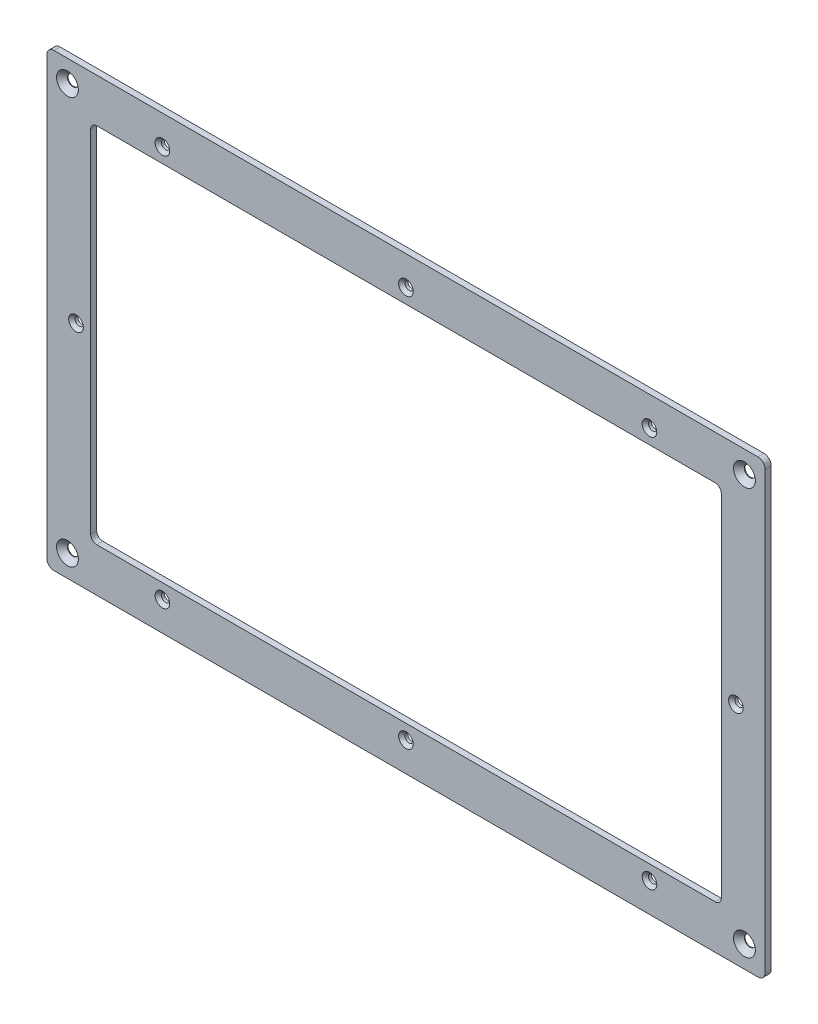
ISO-10303-21;
HEADER;
FILE_DESCRIPTION(('STEP AP214'),'2;1');
FILE_NAME('part.step','',(''),(''),'','','');
FILE_SCHEMA(('AUTOMOTIVE_DESIGN { 1 0 10303 214 1 1 1 1 }'));
ENDSEC;
DATA;
#1=APPLICATION_CONTEXT('core data for automotive mechanical design processes');
#2=APPLICATION_PROTOCOL_DEFINITION('international standard','automotive_design',2000,#1);
#3=PRODUCT_CONTEXT('',#1,'mechanical');
#4=PRODUCT('Part','Part','',(#3));
#5=PRODUCT_RELATED_PRODUCT_CATEGORY('part','',(#4));
#6=PRODUCT_DEFINITION_FORMATION('','',#4);
#7=PRODUCT_DEFINITION_CONTEXT('part definition',#1,'design');
#8=PRODUCT_DEFINITION('design','',#6,#7);
#9=PRODUCT_DEFINITION_SHAPE('','',#8);
#10=(LENGTH_UNIT() NAMED_UNIT(*) SI_UNIT(.MILLI.,.METRE.));
#11=(NAMED_UNIT(*) PLANE_ANGLE_UNIT() SI_UNIT($,.RADIAN.));
#12=(NAMED_UNIT(*) SI_UNIT($,.STERADIAN.) SOLID_ANGLE_UNIT());
#13=UNCERTAINTY_MEASURE_WITH_UNIT(LENGTH_MEASURE(1.E-05),#10,'distance_accuracy_value','');
#14=(GEOMETRIC_REPRESENTATION_CONTEXT(3) GLOBAL_UNCERTAINTY_ASSIGNED_CONTEXT((#13)) GLOBAL_UNIT_ASSIGNED_CONTEXT((#10,
#11,#12)) REPRESENTATION_CONTEXT('',''));
#15=CARTESIAN_POINT('',(0.,0.,0.));
#16=DIRECTION('',(0.,0.,1.));
#17=DIRECTION('',(1.,0.,0.));
#18=AXIS2_PLACEMENT_3D('',#15,#16,#17);
#19=CARTESIAN_POINT('',(144.5,-89.5,1.25));
#20=DIRECTION('',(0.,0.,-1.));
#21=DIRECTION('',(-1.,0.,0.));
#22=AXIS2_PLACEMENT_3D('',#19,#20,#21);
#23=CYLINDRICAL_SURFACE('',#22,3.00000000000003);
#24=CARTESIAN_POINT('',(144.5,-89.5,-1.25));
#25=DIRECTION('',(0.,0.,1.));
#26=DIRECTION('',(-1.,0.,0.));
#27=AXIS2_PLACEMENT_3D('',#24,#25,#26);
#28=CIRCLE('',#27,3.00000000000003);
#29=CARTESIAN_POINT('',(144.5,-92.5,-1.25));
#30=VERTEX_POINT('',#29);
#31=CARTESIAN_POINT('',(147.5,-89.5,-1.25));
#32=VERTEX_POINT('',#31);
#33=EDGE_CURVE('E205',#30,#32,#28,.T.);
#34=ORIENTED_EDGE('',*,*,#33,.T.);
#35=DIRECTION('',(0.,0.,-1.));
#36=VECTOR('',#35,1.);
#37=CARTESIAN_POINT('',(147.5,-89.5,1.25));
#38=LINE('',#37,#36);
#39=CARTESIAN_POINT('',(147.5,-89.5,1.25));
#40=VERTEX_POINT('',#39);
#41=EDGE_CURVE('E11',#40,#32,#38,.T.);
#42=ORIENTED_EDGE('',*,*,#41,.F.);
#43=CARTESIAN_POINT('',(144.5,-89.5,1.25));
#44=DIRECTION('',(0.,0.,1.));
#45=DIRECTION('',(-1.,0.,0.));
#46=AXIS2_PLACEMENT_3D('',#43,#44,#45);
#47=CIRCLE('',#46,3.00000000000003);
#48=CARTESIAN_POINT('',(144.5,-92.5,1.25));
#49=VERTEX_POINT('',#48);
#50=EDGE_CURVE('E217',#49,#40,#47,.T.);
#51=ORIENTED_EDGE('',*,*,#50,.F.);
#52=DIRECTION('',(0.,0.,-1.));
#53=VECTOR('',#52,1.);
#54=CARTESIAN_POINT('',(144.5,-92.5,1.25));
#55=LINE('',#54,#53);
#56=EDGE_CURVE('E235',#49,#30,#55,.T.);
#57=ORIENTED_EDGE('',*,*,#56,.T.);
#58=EDGE_LOOP('',(#34,#42,#51,#57));
#59=FACE_BOUND('',#58,.T.);
#60=ADVANCED_FACE('F33',(#59),#23,.T.);
#61=CARTESIAN_POINT('',(147.5,89.5,1.25));
#62=DIRECTION('',(-1.,0.,0.));
#63=DIRECTION('',(0.,-1.,0.));
#64=AXIS2_PLACEMENT_3D('',#61,#62,#63);
#65=PLANE('',#64);
#66=DIRECTION('',(0.,1.,0.));
#67=VECTOR('',#66,1.);
#68=CARTESIAN_POINT('',(147.5,89.5,-1.25));
#69=LINE('',#68,#67);
#70=CARTESIAN_POINT('',(147.5,89.5,-1.25));
#71=VERTEX_POINT('',#70);
#72=EDGE_CURVE('E238',#32,#71,#69,.T.);
#73=ORIENTED_EDGE('',*,*,#72,.T.);
#74=DIRECTION('',(0.,0.,-1.));
#75=VECTOR('',#74,1.);
#76=CARTESIAN_POINT('',(147.5,89.5,1.25));
#77=LINE('',#76,#75);
#78=CARTESIAN_POINT('',(147.5,89.5,1.25));
#79=VERTEX_POINT('',#78);
#80=EDGE_CURVE('E40',#79,#71,#77,.T.);
#81=ORIENTED_EDGE('',*,*,#80,.F.);
#82=DIRECTION('',(0.,1.,0.));
#83=VECTOR('',#82,1.);
#84=CARTESIAN_POINT('',(147.5,89.5,1.25));
#85=LINE('',#84,#83);
#86=EDGE_CURVE('E220',#40,#79,#85,.T.);
#87=ORIENTED_EDGE('',*,*,#86,.F.);
#88=ORIENTED_EDGE('',*,*,#41,.T.);
#89=EDGE_LOOP('',(#73,#81,#87,#88));
#90=FACE_BOUND('',#89,.T.);
#91=ADVANCED_FACE('F293',(#90),#65,.F.);
#92=CARTESIAN_POINT('',(144.5,89.5,1.25));
#93=DIRECTION('',(0.,0.,-1.));
#94=DIRECTION('',(-1.,0.,0.));
#95=AXIS2_PLACEMENT_3D('',#92,#93,#94);
#96=CYLINDRICAL_SURFACE('',#95,3.00000000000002);
#97=CARTESIAN_POINT('',(144.5,89.5,-1.25));
#98=DIRECTION('',(0.,0.,1.));
#99=DIRECTION('',(-1.,0.,0.));
#100=AXIS2_PLACEMENT_3D('',#97,#98,#99);
#101=CIRCLE('',#100,3.00000000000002);
#102=CARTESIAN_POINT('',(144.5,92.5,-1.25));
#103=VERTEX_POINT('',#102);
#104=EDGE_CURVE('E240',#71,#103,#101,.T.);
#105=ORIENTED_EDGE('',*,*,#104,.T.);
#106=DIRECTION('',(0.,0.,-1.));
#107=VECTOR('',#106,1.);
#108=CARTESIAN_POINT('',(144.5,92.5,1.25));
#109=LINE('',#108,#107);
#110=CARTESIAN_POINT('',(144.5,92.5,1.25));
#111=VERTEX_POINT('',#110);
#112=EDGE_CURVE('E265',#111,#103,#109,.T.);
#113=ORIENTED_EDGE('',*,*,#112,.F.);
#114=CARTESIAN_POINT('',(144.5,89.5,1.25));
#115=DIRECTION('',(0.,0.,1.));
#116=DIRECTION('',(-1.,0.,0.));
#117=AXIS2_PLACEMENT_3D('',#114,#115,#116);
#118=CIRCLE('',#117,3.00000000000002);
#119=EDGE_CURVE('E223',#79,#111,#118,.T.);
#120=ORIENTED_EDGE('',*,*,#119,.F.);
#121=ORIENTED_EDGE('',*,*,#80,.T.);
#122=EDGE_LOOP('',(#105,#113,#120,#121));
#123=FACE_BOUND('',#122,.T.);
#124=ADVANCED_FACE('F272',(#123),#96,.T.);
#125=CARTESIAN_POINT('',(-144.5,92.5,1.25));
#126=DIRECTION('',(0.,-1.,0.));
#127=DIRECTION('',(0.,0.,-1.));
#128=AXIS2_PLACEMENT_3D('',#125,#126,#127);
#129=PLANE('',#128);
#130=DIRECTION('',(-1.,0.,0.));
#131=VECTOR('',#130,1.);
#132=CARTESIAN_POINT('',(-144.5,92.5,-1.25));
#133=LINE('',#132,#131);
#134=CARTESIAN_POINT('',(-144.5,92.5,-1.25));
#135=VERTEX_POINT('',#134);
#136=EDGE_CURVE('E242',#103,#135,#133,.T.);
#137=ORIENTED_EDGE('',*,*,#136,.T.);
#138=DIRECTION('',(0.,0.,-1.));
#139=VECTOR('',#138,1.);
#140=CARTESIAN_POINT('',(-144.5,92.5,1.25));
#141=LINE('',#140,#139);
#142=CARTESIAN_POINT('',(-144.5,92.5,1.25));
#143=VERTEX_POINT('',#142);
#144=EDGE_CURVE('E262',#143,#135,#141,.T.);
#145=ORIENTED_EDGE('',*,*,#144,.F.);
#146=DIRECTION('',(-1.,0.,0.));
#147=VECTOR('',#146,1.);
#148=CARTESIAN_POINT('',(-144.5,92.5,1.25));
#149=LINE('',#148,#147);
#150=EDGE_CURVE('E225',#111,#143,#149,.T.);
#151=ORIENTED_EDGE('',*,*,#150,.F.);
#152=ORIENTED_EDGE('',*,*,#112,.T.);
#153=EDGE_LOOP('',(#137,#145,#151,#152));
#154=FACE_BOUND('',#153,.T.);
#155=ADVANCED_FACE('F281',(#154),#129,.F.);
#156=CARTESIAN_POINT('',(-144.5,89.5,1.25));
#157=DIRECTION('',(0.,0.,-1.));
#158=DIRECTION('',(-1.,0.,0.));
#159=AXIS2_PLACEMENT_3D('',#156,#157,#158);
#160=CYLINDRICAL_SURFACE('',#159,3.);
#161=CARTESIAN_POINT('',(-144.5,89.5,-1.25));
#162=DIRECTION('',(0.,0.,1.));
#163=DIRECTION('',(-1.,0.,0.));
#164=AXIS2_PLACEMENT_3D('',#161,#162,#163);
#165=CIRCLE('',#164,3.);
#166=CARTESIAN_POINT('',(-147.5,89.5,-1.25));
#167=VERTEX_POINT('',#166);
#168=EDGE_CURVE('E244',#135,#167,#165,.T.);
#169=ORIENTED_EDGE('',*,*,#168,.T.);
#170=DIRECTION('',(0.,0.,-1.));
#171=VECTOR('',#170,1.);
#172=CARTESIAN_POINT('',(-147.5,89.5,1.25));
#173=LINE('',#172,#171);
#174=CARTESIAN_POINT('',(-147.5,89.5,1.25));
#175=VERTEX_POINT('',#174);
#176=EDGE_CURVE('E259',#175,#167,#173,.T.);
#177=ORIENTED_EDGE('',*,*,#176,.F.);
#178=CARTESIAN_POINT('',(-144.5,89.5,1.25));
#179=DIRECTION('',(0.,0.,1.));
#180=DIRECTION('',(-1.,0.,0.));
#181=AXIS2_PLACEMENT_3D('',#178,#179,#180);
#182=CIRCLE('',#181,3.);
#183=EDGE_CURVE('E227',#143,#175,#182,.T.);
#184=ORIENTED_EDGE('',*,*,#183,.F.);
#185=ORIENTED_EDGE('',*,*,#144,.T.);
#186=EDGE_LOOP('',(#169,#177,#184,#185));
#187=FACE_BOUND('',#186,.T.);
#188=ADVANCED_FACE('F285',(#187),#160,.T.);
#189=CARTESIAN_POINT('',(-147.5,89.5,1.25));
#190=DIRECTION('',(1.,0.,0.));
#191=DIRECTION('',(0.,1.,0.));
#192=AXIS2_PLACEMENT_3D('',#189,#190,#191);
#193=PLANE('',#192);
#194=DIRECTION('',(0.,-1.,0.));
#195=VECTOR('',#194,1.);
#196=CARTESIAN_POINT('',(-147.5,89.5,-1.25));
#197=LINE('',#196,#195);
#198=CARTESIAN_POINT('',(-147.5,-89.5,-1.25));
#199=VERTEX_POINT('',#198);
#200=EDGE_CURVE('E246',#167,#199,#197,.T.);
#201=ORIENTED_EDGE('',*,*,#200,.T.);
#202=DIRECTION('',(0.,0.,-1.));
#203=VECTOR('',#202,1.);
#204=CARTESIAN_POINT('',(-147.5,-89.5,1.25));
#205=LINE('',#204,#203);
#206=CARTESIAN_POINT('',(-147.5,-89.5,1.25));
#207=VERTEX_POINT('',#206);
#208=EDGE_CURVE('E256',#207,#199,#205,.T.);
#209=ORIENTED_EDGE('',*,*,#208,.F.);
#210=DIRECTION('',(0.,-1.,0.));
#211=VECTOR('',#210,1.);
#212=CARTESIAN_POINT('',(-147.5,89.5,1.25));
#213=LINE('',#212,#211);
#214=EDGE_CURVE('E229',#175,#207,#213,.T.);
#215=ORIENTED_EDGE('',*,*,#214,.F.);
#216=ORIENTED_EDGE('',*,*,#176,.T.);
#217=EDGE_LOOP('',(#201,#209,#215,#216));
#218=FACE_BOUND('',#217,.T.);
#219=ADVANCED_FACE('F306',(#218),#193,.F.);
#220=CARTESIAN_POINT('',(-144.5,-89.5,1.25));
#221=DIRECTION('',(0.,0.,-1.));
#222=DIRECTION('',(-1.,0.,0.));
#223=AXIS2_PLACEMENT_3D('',#220,#221,#222);
#224=CYLINDRICAL_SURFACE('',#223,3.);
#225=CARTESIAN_POINT('',(-144.5,-89.5,-1.25));
#226=DIRECTION('',(0.,0.,1.));
#227=DIRECTION('',(-1.,0.,0.));
#228=AXIS2_PLACEMENT_3D('',#225,#226,#227);
#229=CIRCLE('',#228,3.);
#230=CARTESIAN_POINT('',(-144.5,-92.5,-1.25));
#231=VERTEX_POINT('',#230);
#232=EDGE_CURVE('E248',#199,#231,#229,.T.);
#233=ORIENTED_EDGE('',*,*,#232,.T.);
#234=DIRECTION('',(0.,0.,-1.));
#235=VECTOR('',#234,1.);
#236=CARTESIAN_POINT('',(-144.5,-92.5,1.25));
#237=LINE('',#236,#235);
#238=CARTESIAN_POINT('',(-144.5,-92.5,1.25));
#239=VERTEX_POINT('',#238);
#240=EDGE_CURVE('E253',#239,#231,#237,.T.);
#241=ORIENTED_EDGE('',*,*,#240,.F.);
#242=CARTESIAN_POINT('',(-144.5,-89.5,1.25));
#243=DIRECTION('',(0.,0.,1.));
#244=DIRECTION('',(-1.,0.,0.));
#245=AXIS2_PLACEMENT_3D('',#242,#243,#244);
#246=CIRCLE('',#245,3.);
#247=EDGE_CURVE('E231',#207,#239,#246,.T.);
#248=ORIENTED_EDGE('',*,*,#247,.F.);
#249=ORIENTED_EDGE('',*,*,#208,.T.);
#250=EDGE_LOOP('',(#233,#241,#248,#249));
#251=FACE_BOUND('',#250,.T.);
#252=ADVANCED_FACE('F304',(#251),#224,.T.);
#253=CARTESIAN_POINT('',(-144.5,-92.5,1.25));
#254=DIRECTION('',(0.,1.,0.));
#255=DIRECTION('',(0.,0.,1.));
#256=AXIS2_PLACEMENT_3D('',#253,#254,#255);
#257=PLANE('',#256);
#258=DIRECTION('',(1.,0.,0.));
#259=VECTOR('',#258,1.);
#260=CARTESIAN_POINT('',(-144.5,-92.5,-1.25));
#261=LINE('',#260,#259);
#262=EDGE_CURVE('E221',#231,#30,#261,.T.);
#263=ORIENTED_EDGE('',*,*,#262,.T.);
#264=ORIENTED_EDGE('',*,*,#56,.F.);
#265=DIRECTION('',(1.,0.,0.));
#266=VECTOR('',#265,1.);
#267=CARTESIAN_POINT('',(-144.5,-92.5,1.25));
#268=LINE('',#267,#266);
#269=EDGE_CURVE('E233',#239,#49,#268,.T.);
#270=ORIENTED_EDGE('',*,*,#269,.F.);
#271=ORIENTED_EDGE('',*,*,#240,.T.);
#272=EDGE_LOOP('',(#263,#264,#270,#271));
#273=FACE_BOUND('',#272,.T.);
#274=ADVANCED_FACE('F299',(#273),#257,.F.);
#275=CARTESIAN_POINT('',(144.5,-89.5,1.25));
#276=DIRECTION('',(0.,0.,-1.));
#277=DIRECTION('',(-1.,0.,0.));
#278=AXIS2_PLACEMENT_3D('',#275,#276,#277);
#279=PLANE('',#278);
#280=CARTESIAN_POINT('',(-139.,-83.5,1.25));
#281=DIRECTION('',(0.,0.,1.));
#282=DIRECTION('',(1.,0.,0.));
#283=AXIS2_PLACEMENT_3D('',#280,#281,#282);
#284=CIRCLE('',#283,4.48000000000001);
#285=CARTESIAN_POINT('',(-134.52,-83.5,1.25));
#286=VERTEX_POINT('',#285);
#287=EDGE_CURVE('E694',#286,#286,#284,.T.);
#288=ORIENTED_EDGE('',*,*,#287,.F.);
#289=EDGE_LOOP('',(#288));
#290=FACE_BOUND('',#289,.T.);
#291=CARTESIAN_POINT('',(139.,-83.5,1.25));
#292=DIRECTION('',(0.,0.,1.));
#293=DIRECTION('',(1.,0.,0.));
#294=AXIS2_PLACEMENT_3D('',#291,#292,#293);
#295=CIRCLE('',#294,4.48000000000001);
#296=CARTESIAN_POINT('',(143.48,-83.5,1.25));
#297=VERTEX_POINT('',#296);
#298=EDGE_CURVE('E701',#297,#297,#295,.T.);
#299=ORIENTED_EDGE('',*,*,#298,.F.);
#300=EDGE_LOOP('',(#299));
#301=FACE_BOUND('',#300,.T.);
#302=CARTESIAN_POINT('',(-139.,83.5,1.25));
#303=DIRECTION('',(0.,0.,1.));
#304=DIRECTION('',(1.,0.,0.));
#305=AXIS2_PLACEMENT_3D('',#302,#303,#304);
#306=CIRCLE('',#305,4.48000000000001);
#307=CARTESIAN_POINT('',(-134.52,83.5,1.25));
#308=VERTEX_POINT('',#307);
#309=EDGE_CURVE('E710',#308,#308,#306,.T.);
#310=ORIENTED_EDGE('',*,*,#309,.F.);
#311=EDGE_LOOP('',(#310));
#312=FACE_BOUND('',#311,.T.);
#313=CARTESIAN_POINT('',(0.,80.5,1.25));
#314=DIRECTION('',(0.,0.,1.));
#315=DIRECTION('',(1.,0.,0.));
#316=AXIS2_PLACEMENT_3D('',#313,#314,#315);
#317=CIRCLE('',#316,3.);
#318=CARTESIAN_POINT('',(3.,80.5,1.25));
#319=VERTEX_POINT('',#318);
#320=EDGE_CURVE('E719',#319,#319,#317,.T.);
#321=ORIENTED_EDGE('',*,*,#320,.F.);
#322=EDGE_LOOP('',(#321));
#323=FACE_BOUND('',#322,.T.);
#324=CARTESIAN_POINT('',(-100.,80.5,1.25));
#325=DIRECTION('',(0.,0.,1.));
#326=DIRECTION('',(1.,0.,0.));
#327=AXIS2_PLACEMENT_3D('',#324,#325,#326);
#328=CIRCLE('',#327,3.);
#329=CARTESIAN_POINT('',(-97.,80.5,1.25));
#330=VERTEX_POINT('',#329);
#331=EDGE_CURVE('E728',#330,#330,#328,.T.);
#332=ORIENTED_EDGE('',*,*,#331,.F.);
#333=EDGE_LOOP('',(#332));
#334=FACE_BOUND('',#333,.T.);
#335=CARTESIAN_POINT('',(100.,80.5,1.25));
#336=DIRECTION('',(0.,0.,1.));
#337=DIRECTION('',(1.,0.,0.));
#338=AXIS2_PLACEMENT_3D('',#335,#336,#337);
#339=CIRCLE('',#338,3.);
#340=CARTESIAN_POINT('',(103.,80.5,1.25));
#341=VERTEX_POINT('',#340);
#342=EDGE_CURVE('E737',#341,#341,#339,.T.);
#343=ORIENTED_EDGE('',*,*,#342,.F.);
#344=EDGE_LOOP('',(#343));
#345=FACE_BOUND('',#344,.T.);
#346=CARTESIAN_POINT('',(0.,-80.5,1.25));
#347=DIRECTION('',(0.,0.,1.));
#348=DIRECTION('',(1.,0.,0.));
#349=AXIS2_PLACEMENT_3D('',#346,#347,#348);
#350=CIRCLE('',#349,3.);
#351=CARTESIAN_POINT('',(3.,-80.5,1.25));
#352=VERTEX_POINT('',#351);
#353=EDGE_CURVE('E746',#352,#352,#350,.T.);
#354=ORIENTED_EDGE('',*,*,#353,.F.);
#355=EDGE_LOOP('',(#354));
#356=FACE_BOUND('',#355,.T.);
#357=CARTESIAN_POINT('',(-100.,-80.5,1.25));
#358=DIRECTION('',(0.,0.,1.));
#359=DIRECTION('',(1.,0.,0.));
#360=AXIS2_PLACEMENT_3D('',#357,#358,#359);
#361=CIRCLE('',#360,3.);
#362=CARTESIAN_POINT('',(-97.,-80.5,1.25));
#363=VERTEX_POINT('',#362);
#364=EDGE_CURVE('E755',#363,#363,#361,.T.);
#365=ORIENTED_EDGE('',*,*,#364,.F.);
#366=EDGE_LOOP('',(#365));
#367=FACE_BOUND('',#366,.T.);
#368=CARTESIAN_POINT('',(100.,-80.5,1.25));
#369=DIRECTION('',(0.,0.,1.));
#370=DIRECTION('',(1.,0.,0.));
#371=AXIS2_PLACEMENT_3D('',#368,#369,#370);
#372=CIRCLE('',#371,3.);
#373=CARTESIAN_POINT('',(103.,-80.5,1.25));
#374=VERTEX_POINT('',#373);
#375=EDGE_CURVE('E764',#374,#374,#372,.T.);
#376=ORIENTED_EDGE('',*,*,#375,.F.);
#377=EDGE_LOOP('',(#376));
#378=FACE_BOUND('',#377,.T.);
#379=CARTESIAN_POINT('',(-135.5,0.,1.25));
#380=DIRECTION('',(0.,0.,1.));
#381=DIRECTION('',(1.,0.,0.));
#382=AXIS2_PLACEMENT_3D('',#379,#380,#381);
#383=CIRCLE('',#382,3.);
#384=CARTESIAN_POINT('',(-132.5,0.,1.25));
#385=VERTEX_POINT('',#384);
#386=EDGE_CURVE('E773',#385,#385,#383,.T.);
#387=ORIENTED_EDGE('',*,*,#386,.F.);
#388=EDGE_LOOP('',(#387));
#389=FACE_BOUND('',#388,.T.);
#390=CARTESIAN_POINT('',(135.5,0.,1.25));
#391=DIRECTION('',(0.,0.,1.));
#392=DIRECTION('',(1.,0.,0.));
#393=AXIS2_PLACEMENT_3D('',#390,#391,#392);
#394=CIRCLE('',#393,3.);
#395=CARTESIAN_POINT('',(138.5,0.,1.25));
#396=VERTEX_POINT('',#395);
#397=EDGE_CURVE('E782',#396,#396,#394,.T.);
#398=ORIENTED_EDGE('',*,*,#397,.F.);
#399=EDGE_LOOP('',(#398));
#400=FACE_BOUND('',#399,.T.);
#401=CARTESIAN_POINT('',(139.,83.5,1.25));
#402=DIRECTION('',(0.,0.,1.));
#403=DIRECTION('',(1.,0.,0.));
#404=AXIS2_PLACEMENT_3D('',#401,#402,#403);
#405=CIRCLE('',#404,4.48000000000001);
#406=CARTESIAN_POINT('',(143.48,83.5,1.25));
#407=VERTEX_POINT('',#406);
#408=EDGE_CURVE('E791',#407,#407,#405,.T.);
#409=ORIENTED_EDGE('',*,*,#408,.F.);
#410=EDGE_LOOP('',(#409));
#411=FACE_BOUND('',#410,.T.);
#412=DIRECTION('',(-1.,0.,0.));
#413=VECTOR('',#412,1.);
#414=CARTESIAN_POINT('',(-127.,74.5,1.25));
#415=LINE('',#414,#413);
#416=CARTESIAN_POINT('',(127.,74.5,1.25));
#417=VERTEX_POINT('',#416);
#418=CARTESIAN_POINT('',(-127.,74.5,1.25));
#419=VERTEX_POINT('',#418);
#420=EDGE_CURVE('E187',#417,#419,#415,.T.);
#421=ORIENTED_EDGE('',*,*,#420,.F.);
#422=CARTESIAN_POINT('',(127.,72.,1.25));
#423=DIRECTION('',(0.,0.,1.));
#424=DIRECTION('',(1.,0.,0.));
#425=AXIS2_PLACEMENT_3D('',#422,#423,#424);
#426=CIRCLE('',#425,2.50000000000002);
#427=CARTESIAN_POINT('',(129.5,72.,1.25));
#428=VERTEX_POINT('',#427);
#429=EDGE_CURVE('E47',#428,#417,#426,.T.);
#430=ORIENTED_EDGE('',*,*,#429,.F.);
#431=DIRECTION('',(0.,1.,0.));
#432=VECTOR('',#431,1.);
#433=CARTESIAN_POINT('',(129.5,72.,1.25));
#434=LINE('',#433,#432);
#435=CARTESIAN_POINT('',(129.5,-72.,1.25));
#436=VERTEX_POINT('',#435);
#437=EDGE_CURVE('E164',#436,#428,#434,.T.);
#438=ORIENTED_EDGE('',*,*,#437,.F.);
#439=CARTESIAN_POINT('',(127.,-72.,1.25));
#440=DIRECTION('',(0.,0.,1.));
#441=DIRECTION('',(-1.,0.,0.));
#442=AXIS2_PLACEMENT_3D('',#439,#440,#441);
#443=CIRCLE('',#442,2.50000000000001);
#444=CARTESIAN_POINT('',(127.,-74.5,1.25));
#445=VERTEX_POINT('',#444);
#446=EDGE_CURVE('E167',#445,#436,#443,.T.);
#447=ORIENTED_EDGE('',*,*,#446,.F.);
#448=DIRECTION('',(1.,0.,0.));
#449=VECTOR('',#448,1.);
#450=CARTESIAN_POINT('',(-127.,-74.5,1.25));
#451=LINE('',#450,#449);
#452=CARTESIAN_POINT('',(-127.,-74.5,1.25));
#453=VERTEX_POINT('',#452);
#454=EDGE_CURVE('E198',#453,#445,#451,.T.);
#455=ORIENTED_EDGE('',*,*,#454,.F.);
#456=CARTESIAN_POINT('',(-127.,-72.,1.25));
#457=DIRECTION('',(0.,0.,1.));
#458=DIRECTION('',(-1.,0.,0.));
#459=AXIS2_PLACEMENT_3D('',#456,#457,#458);
#460=CIRCLE('',#459,2.5);
#461=CARTESIAN_POINT('',(-129.5,-72.,1.25));
#462=VERTEX_POINT('',#461);
#463=EDGE_CURVE('E195',#462,#453,#460,.T.);
#464=ORIENTED_EDGE('',*,*,#463,.F.);
#465=DIRECTION('',(0.,-1.,0.));
#466=VECTOR('',#465,1.);
#467=CARTESIAN_POINT('',(-129.5,72.,1.25));
#468=LINE('',#467,#466);
#469=CARTESIAN_POINT('',(-129.5,72.,1.25));
#470=VERTEX_POINT('',#469);
#471=EDGE_CURVE('E192',#470,#462,#468,.T.);
#472=ORIENTED_EDGE('',*,*,#471,.F.);
#473=CARTESIAN_POINT('',(-127.,72.,1.25));
#474=DIRECTION('',(0.,0.,1.));
#475=DIRECTION('',(-1.,0.,0.));
#476=AXIS2_PLACEMENT_3D('',#473,#474,#475);
#477=CIRCLE('',#476,2.5);
#478=EDGE_CURVE('E189',#419,#470,#477,.T.);
#479=ORIENTED_EDGE('',*,*,#478,.F.);
#480=EDGE_LOOP('',(#421,#430,#438,#447,#455,#464,#472,#479));
#481=FACE_BOUND('',#480,.T.);
#482=ORIENTED_EDGE('',*,*,#50,.T.);
#483=ORIENTED_EDGE('',*,*,#86,.T.);
#484=ORIENTED_EDGE('',*,*,#119,.T.);
#485=ORIENTED_EDGE('',*,*,#150,.T.);
#486=ORIENTED_EDGE('',*,*,#183,.T.);
#487=ORIENTED_EDGE('',*,*,#214,.T.);
#488=ORIENTED_EDGE('',*,*,#247,.T.);
#489=ORIENTED_EDGE('',*,*,#269,.T.);
#490=EDGE_LOOP('',(#482,#483,#484,#485,#486,#487,#488,#489));
#491=FACE_BOUND('',#490,.T.);
#492=ADVANCED_FACE('F289',(#290,#301,#312,#323,#334,#345,#356,#367,#378,#389,#400,#411,#481,
#491),#279,.F.);
#493=CARTESIAN_POINT('',(144.5,-89.5,-1.25));
#494=DIRECTION('',(0.,0.,-1.));
#495=DIRECTION('',(-1.,0.,0.));
#496=AXIS2_PLACEMENT_3D('',#493,#494,#495);
#497=PLANE('',#496);
#498=CARTESIAN_POINT('',(-139.,-83.5,-1.25));
#499=DIRECTION('',(0.,0.,1.));
#500=DIRECTION('',(1.,0.,0.));
#501=AXIS2_PLACEMENT_3D('',#498,#499,#500);
#502=CIRCLE('',#501,2.25);
#503=CARTESIAN_POINT('',(-136.75,-83.5,-1.25));
#504=VERTEX_POINT('',#503);
#505=EDGE_CURVE('E696',#504,#504,#502,.T.);
#506=ORIENTED_EDGE('',*,*,#505,.T.);
#507=EDGE_LOOP('',(#506));
#508=FACE_BOUND('',#507,.T.);
#509=CARTESIAN_POINT('',(139.,-83.5,-1.25));
#510=DIRECTION('',(0.,0.,1.));
#511=DIRECTION('',(1.,0.,0.));
#512=AXIS2_PLACEMENT_3D('',#509,#510,#511);
#513=CIRCLE('',#512,2.25);
#514=CARTESIAN_POINT('',(141.25,-83.5,-1.25));
#515=VERTEX_POINT('',#514);
#516=EDGE_CURVE('E707',#515,#515,#513,.T.);
#517=ORIENTED_EDGE('',*,*,#516,.T.);
#518=EDGE_LOOP('',(#517));
#519=FACE_BOUND('',#518,.T.);
#520=CARTESIAN_POINT('',(-139.,83.5,-1.25));
#521=DIRECTION('',(0.,0.,1.));
#522=DIRECTION('',(1.,0.,0.));
#523=AXIS2_PLACEMENT_3D('',#520,#521,#522);
#524=CIRCLE('',#523,2.25);
#525=CARTESIAN_POINT('',(-136.75,83.5,-1.25));
#526=VERTEX_POINT('',#525);
#527=EDGE_CURVE('E716',#526,#526,#524,.T.);
#528=ORIENTED_EDGE('',*,*,#527,.T.);
#529=EDGE_LOOP('',(#528));
#530=FACE_BOUND('',#529,.T.);
#531=CARTESIAN_POINT('',(0.,80.5,-1.25));
#532=DIRECTION('',(0.,0.,1.));
#533=DIRECTION('',(1.,0.,0.));
#534=AXIS2_PLACEMENT_3D('',#531,#532,#533);
#535=CIRCLE('',#534,1.7);
#536=CARTESIAN_POINT('',(1.7,80.5,-1.25));
#537=VERTEX_POINT('',#536);
#538=EDGE_CURVE('E725',#537,#537,#535,.T.);
#539=ORIENTED_EDGE('',*,*,#538,.T.);
#540=EDGE_LOOP('',(#539));
#541=FACE_BOUND('',#540,.T.);
#542=CARTESIAN_POINT('',(-100.,80.5,-1.25));
#543=DIRECTION('',(0.,0.,1.));
#544=DIRECTION('',(1.,0.,0.));
#545=AXIS2_PLACEMENT_3D('',#542,#543,#544);
#546=CIRCLE('',#545,1.69999999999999);
#547=CARTESIAN_POINT('',(-98.3,80.5,-1.25));
#548=VERTEX_POINT('',#547);
#549=EDGE_CURVE('E734',#548,#548,#546,.T.);
#550=ORIENTED_EDGE('',*,*,#549,.T.);
#551=EDGE_LOOP('',(#550));
#552=FACE_BOUND('',#551,.T.);
#553=CARTESIAN_POINT('',(100.,80.5,-1.25));
#554=DIRECTION('',(0.,0.,1.));
#555=DIRECTION('',(1.,0.,0.));
#556=AXIS2_PLACEMENT_3D('',#553,#554,#555);
#557=CIRCLE('',#556,1.69999999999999);
#558=CARTESIAN_POINT('',(101.7,80.5,-1.25));
#559=VERTEX_POINT('',#558);
#560=EDGE_CURVE('E743',#559,#559,#557,.T.);
#561=ORIENTED_EDGE('',*,*,#560,.T.);
#562=EDGE_LOOP('',(#561));
#563=FACE_BOUND('',#562,.T.);
#564=CARTESIAN_POINT('',(0.,-80.5,-1.25));
#565=DIRECTION('',(0.,0.,1.));
#566=DIRECTION('',(1.,0.,0.));
#567=AXIS2_PLACEMENT_3D('',#564,#565,#566);
#568=CIRCLE('',#567,1.7);
#569=CARTESIAN_POINT('',(1.7,-80.5,-1.25));
#570=VERTEX_POINT('',#569);
#571=EDGE_CURVE('E752',#570,#570,#568,.T.);
#572=ORIENTED_EDGE('',*,*,#571,.T.);
#573=EDGE_LOOP('',(#572));
#574=FACE_BOUND('',#573,.T.);
#575=CARTESIAN_POINT('',(-100.,-80.5,-1.25));
#576=DIRECTION('',(0.,0.,1.));
#577=DIRECTION('',(1.,0.,0.));
#578=AXIS2_PLACEMENT_3D('',#575,#576,#577);
#579=CIRCLE('',#578,1.69999999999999);
#580=CARTESIAN_POINT('',(-98.3,-80.5,-1.25));
#581=VERTEX_POINT('',#580);
#582=EDGE_CURVE('E761',#581,#581,#579,.T.);
#583=ORIENTED_EDGE('',*,*,#582,.T.);
#584=EDGE_LOOP('',(#583));
#585=FACE_BOUND('',#584,.T.);
#586=CARTESIAN_POINT('',(100.,-80.5,-1.25));
#587=DIRECTION('',(0.,0.,1.));
#588=DIRECTION('',(1.,0.,0.));
#589=AXIS2_PLACEMENT_3D('',#586,#587,#588);
#590=CIRCLE('',#589,1.69999999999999);
#591=CARTESIAN_POINT('',(101.7,-80.5,-1.25));
#592=VERTEX_POINT('',#591);
#593=EDGE_CURVE('E770',#592,#592,#590,.T.);
#594=ORIENTED_EDGE('',*,*,#593,.T.);
#595=EDGE_LOOP('',(#594));
#596=FACE_BOUND('',#595,.T.);
#597=CARTESIAN_POINT('',(-135.5,0.,-1.25));
#598=DIRECTION('',(0.,0.,1.));
#599=DIRECTION('',(1.,0.,0.));
#600=AXIS2_PLACEMENT_3D('',#597,#598,#599);
#601=CIRCLE('',#600,1.70000000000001);
#602=CARTESIAN_POINT('',(-133.8,0.,-1.25));
#603=VERTEX_POINT('',#602);
#604=EDGE_CURVE('E779',#603,#603,#601,.T.);
#605=ORIENTED_EDGE('',*,*,#604,.T.);
#606=EDGE_LOOP('',(#605));
#607=FACE_BOUND('',#606,.T.);
#608=CARTESIAN_POINT('',(135.5,0.,-1.25));
#609=DIRECTION('',(0.,0.,1.));
#610=DIRECTION('',(1.,0.,0.));
#611=AXIS2_PLACEMENT_3D('',#608,#609,#610);
#612=CIRCLE('',#611,1.70000000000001);
#613=CARTESIAN_POINT('',(137.2,0.,-1.25));
#614=VERTEX_POINT('',#613);
#615=EDGE_CURVE('E788',#614,#614,#612,.T.);
#616=ORIENTED_EDGE('',*,*,#615,.T.);
#617=EDGE_LOOP('',(#616));
#618=FACE_BOUND('',#617,.T.);
#619=CARTESIAN_POINT('',(139.,83.5,-1.25));
#620=DIRECTION('',(0.,0.,1.));
#621=DIRECTION('',(1.,0.,0.));
#622=AXIS2_PLACEMENT_3D('',#619,#620,#621);
#623=CIRCLE('',#622,2.25);
#624=CARTESIAN_POINT('',(141.25,83.5,-1.25));
#625=VERTEX_POINT('',#624);
#626=EDGE_CURVE('E170',#625,#625,#623,.T.);
#627=ORIENTED_EDGE('',*,*,#626,.T.);
#628=EDGE_LOOP('',(#627));
#629=FACE_BOUND('',#628,.T.);
#630=CARTESIAN_POINT('',(127.,72.,-1.25));
#631=DIRECTION('',(0.,0.,1.));
#632=DIRECTION('',(1.,0.,0.));
#633=AXIS2_PLACEMENT_3D('',#630,#631,#632);
#634=CIRCLE('',#633,2.50000000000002);
#635=CARTESIAN_POINT('',(129.5,72.,-1.25));
#636=VERTEX_POINT('',#635);
#637=CARTESIAN_POINT('',(127.,74.5,-1.25));
#638=VERTEX_POINT('',#637);
#639=EDGE_CURVE('E147',#636,#638,#634,.T.);
#640=ORIENTED_EDGE('',*,*,#639,.T.);
#641=DIRECTION('',(-1.,0.,0.));
#642=VECTOR('',#641,1.);
#643=CARTESIAN_POINT('',(-127.,74.5,-1.25));
#644=LINE('',#643,#642);
#645=CARTESIAN_POINT('',(-127.,74.5,-1.25));
#646=VERTEX_POINT('',#645);
#647=EDGE_CURVE('E156',#638,#646,#644,.T.);
#648=ORIENTED_EDGE('',*,*,#647,.T.);
#649=CARTESIAN_POINT('',(-127.,72.,-1.25));
#650=DIRECTION('',(0.,0.,1.));
#651=DIRECTION('',(-1.,0.,0.));
#652=AXIS2_PLACEMENT_3D('',#649,#650,#651);
#653=CIRCLE('',#652,2.5);
#654=CARTESIAN_POINT('',(-129.5,72.,-1.25));
#655=VERTEX_POINT('',#654);
#656=EDGE_CURVE('E55',#646,#655,#653,.T.);
#657=ORIENTED_EDGE('',*,*,#656,.T.);
#658=DIRECTION('',(0.,-1.,0.));
#659=VECTOR('',#658,1.);
#660=CARTESIAN_POINT('',(-129.5,72.,-1.25));
#661=LINE('',#660,#659);
#662=CARTESIAN_POINT('',(-129.5,-72.,-1.25));
#663=VERTEX_POINT('',#662);
#664=EDGE_CURVE('E174',#655,#663,#661,.T.);
#665=ORIENTED_EDGE('',*,*,#664,.T.);
#666=CARTESIAN_POINT('',(-127.,-72.,-1.25));
#667=DIRECTION('',(0.,0.,1.));
#668=DIRECTION('',(-1.,0.,0.));
#669=AXIS2_PLACEMENT_3D('',#666,#667,#668);
#670=CIRCLE('',#669,2.5);
#671=CARTESIAN_POINT('',(-127.,-74.5,-1.25));
#672=VERTEX_POINT('',#671);
#673=EDGE_CURVE('E177',#663,#672,#670,.T.);
#674=ORIENTED_EDGE('',*,*,#673,.T.);
#675=DIRECTION('',(1.,0.,0.));
#676=VECTOR('',#675,1.);
#677=CARTESIAN_POINT('',(-127.,-74.5,-1.25));
#678=LINE('',#677,#676);
#679=CARTESIAN_POINT('',(127.,-74.5,-1.25));
#680=VERTEX_POINT('',#679);
#681=EDGE_CURVE('E180',#672,#680,#678,.T.);
#682=ORIENTED_EDGE('',*,*,#681,.T.);
#683=CARTESIAN_POINT('',(127.,-72.,-1.25));
#684=DIRECTION('',(0.,0.,1.));
#685=DIRECTION('',(-1.,0.,0.));
#686=AXIS2_PLACEMENT_3D('',#683,#684,#685);
#687=CIRCLE('',#686,2.50000000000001);
#688=CARTESIAN_POINT('',(129.5,-72.,-1.25));
#689=VERTEX_POINT('',#688);
#690=EDGE_CURVE('E183',#680,#689,#687,.T.);
#691=ORIENTED_EDGE('',*,*,#690,.T.);
#692=DIRECTION('',(0.,1.,0.));
#693=VECTOR('',#692,1.);
#694=CARTESIAN_POINT('',(129.5,72.,-1.25));
#695=LINE('',#694,#693);
#696=EDGE_CURVE('E153',#689,#636,#695,.T.);
#697=ORIENTED_EDGE('',*,*,#696,.T.);
#698=EDGE_LOOP('',(#640,#648,#657,#665,#674,#682,#691,#697));
#699=FACE_BOUND('',#698,.T.);
#700=ORIENTED_EDGE('',*,*,#33,.F.);
#701=ORIENTED_EDGE('',*,*,#262,.F.);
#702=ORIENTED_EDGE('',*,*,#232,.F.);
#703=ORIENTED_EDGE('',*,*,#200,.F.);
#704=ORIENTED_EDGE('',*,*,#168,.F.);
#705=ORIENTED_EDGE('',*,*,#136,.F.);
#706=ORIENTED_EDGE('',*,*,#104,.F.);
#707=ORIENTED_EDGE('',*,*,#72,.F.);
#708=EDGE_LOOP('',(#700,#701,#702,#703,#704,#705,#706,#707));
#709=FACE_BOUND('',#708,.T.);
#710=ADVANCED_FACE('F160',(#508,#519,#530,#541,#552,#563,#574,#585,#596,#607,#618,#629,#699,
#709),#497,.T.);
#711=CARTESIAN_POINT('',(127.,72.,-1.25));
#712=DIRECTION('',(0.,0.,1.));
#713=DIRECTION('',(1.,0.,0.));
#714=AXIS2_PLACEMENT_3D('',#711,#712,#713);
#715=CYLINDRICAL_SURFACE('',#714,2.50000000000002);
#716=ORIENTED_EDGE('',*,*,#429,.T.);
#717=DIRECTION('',(0.,0.,1.));
#718=VECTOR('',#717,1.);
#719=CARTESIAN_POINT('',(127.,74.5,-1.25));
#720=LINE('',#719,#718);
#721=EDGE_CURVE('E143',#638,#417,#720,.T.);
#722=ORIENTED_EDGE('',*,*,#721,.F.);
#723=ORIENTED_EDGE('',*,*,#639,.F.);
#724=DIRECTION('',(0.,0.,1.));
#725=VECTOR('',#724,1.);
#726=CARTESIAN_POINT('',(129.5,72.,-1.25));
#727=LINE('',#726,#725);
#728=EDGE_CURVE('E203',#636,#428,#727,.T.);
#729=ORIENTED_EDGE('',*,*,#728,.T.);
#730=EDGE_LOOP('',(#716,#722,#723,#729));
#731=FACE_BOUND('',#730,.T.);
#732=ADVANCED_FACE('F145',(#731),#715,.F.);
#733=CARTESIAN_POINT('',(129.5,72.,-1.25));
#734=DIRECTION('',(1.,0.,0.));
#735=DIRECTION('',(0.,1.,0.));
#736=AXIS2_PLACEMENT_3D('',#733,#734,#735);
#737=PLANE('',#736);
#738=ORIENTED_EDGE('',*,*,#437,.T.);
#739=ORIENTED_EDGE('',*,*,#728,.F.);
#740=ORIENTED_EDGE('',*,*,#696,.F.);
#741=DIRECTION('',(0.,0.,1.));
#742=VECTOR('',#741,1.);
#743=CARTESIAN_POINT('',(129.5,-72.,-1.25));
#744=LINE('',#743,#742);
#745=EDGE_CURVE('E206',#689,#436,#744,.T.);
#746=ORIENTED_EDGE('',*,*,#745,.T.);
#747=EDGE_LOOP('',(#738,#739,#740,#746));
#748=FACE_BOUND('',#747,.T.);
#749=ADVANCED_FACE('F362',(#748),#737,.F.);
#750=CARTESIAN_POINT('',(127.,-72.,-1.25));
#751=DIRECTION('',(0.,0.,1.));
#752=DIRECTION('',(1.,0.,0.));
#753=AXIS2_PLACEMENT_3D('',#750,#751,#752);
#754=CYLINDRICAL_SURFACE('',#753,2.50000000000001);
#755=ORIENTED_EDGE('',*,*,#446,.T.);
#756=ORIENTED_EDGE('',*,*,#745,.F.);
#757=ORIENTED_EDGE('',*,*,#690,.F.);
#758=DIRECTION('',(0.,0.,1.));
#759=VECTOR('',#758,1.);
#760=CARTESIAN_POINT('',(127.,-74.5,-1.25));
#761=LINE('',#760,#759);
#762=EDGE_CURVE('E208',#680,#445,#761,.T.);
#763=ORIENTED_EDGE('',*,*,#762,.T.);
#764=EDGE_LOOP('',(#755,#756,#757,#763));
#765=FACE_BOUND('',#764,.T.);
#766=ADVANCED_FACE('F373',(#765),#754,.F.);
#767=CARTESIAN_POINT('',(-127.,-74.5,-1.25));
#768=DIRECTION('',(0.,-1.,0.));
#769=DIRECTION('',(1.,0.,0.));
#770=AXIS2_PLACEMENT_3D('',#767,#768,#769);
#771=PLANE('',#770);
#772=ORIENTED_EDGE('',*,*,#454,.T.);
#773=ORIENTED_EDGE('',*,*,#762,.F.);
#774=ORIENTED_EDGE('',*,*,#681,.F.);
#775=DIRECTION('',(0.,0.,1.));
#776=VECTOR('',#775,1.);
#777=CARTESIAN_POINT('',(-127.,-74.5,-1.25));
#778=LINE('',#777,#776);
#779=EDGE_CURVE('E210',#672,#453,#778,.T.);
#780=ORIENTED_EDGE('',*,*,#779,.T.);
#781=EDGE_LOOP('',(#772,#773,#774,#780));
#782=FACE_BOUND('',#781,.T.);
#783=ADVANCED_FACE('F383',(#782),#771,.F.);
#784=CARTESIAN_POINT('',(-127.,-72.,-1.25));
#785=DIRECTION('',(0.,0.,1.));
#786=DIRECTION('',(1.,0.,0.));
#787=AXIS2_PLACEMENT_3D('',#784,#785,#786);
#788=CYLINDRICAL_SURFACE('',#787,2.5);
#789=ORIENTED_EDGE('',*,*,#463,.T.);
#790=ORIENTED_EDGE('',*,*,#779,.F.);
#791=ORIENTED_EDGE('',*,*,#673,.F.);
#792=DIRECTION('',(0.,0.,1.));
#793=VECTOR('',#792,1.);
#794=CARTESIAN_POINT('',(-129.5,-72.,-1.25));
#795=LINE('',#794,#793);
#796=EDGE_CURVE('E212',#663,#462,#795,.T.);
#797=ORIENTED_EDGE('',*,*,#796,.T.);
#798=EDGE_LOOP('',(#789,#790,#791,#797));
#799=FACE_BOUND('',#798,.T.);
#800=ADVANCED_FACE('F393',(#799),#788,.F.);
#801=CARTESIAN_POINT('',(-129.5,72.,-1.25));
#802=DIRECTION('',(-1.,0.,0.));
#803=DIRECTION('',(0.,-1.,0.));
#804=AXIS2_PLACEMENT_3D('',#801,#802,#803);
#805=PLANE('',#804);
#806=ORIENTED_EDGE('',*,*,#471,.T.);
#807=ORIENTED_EDGE('',*,*,#796,.F.);
#808=ORIENTED_EDGE('',*,*,#664,.F.);
#809=DIRECTION('',(0.,0.,1.));
#810=VECTOR('',#809,1.);
#811=CARTESIAN_POINT('',(-129.5,72.,-1.25));
#812=LINE('',#811,#810);
#813=EDGE_CURVE('E214',#655,#470,#812,.T.);
#814=ORIENTED_EDGE('',*,*,#813,.T.);
#815=EDGE_LOOP('',(#806,#807,#808,#814));
#816=FACE_BOUND('',#815,.T.);
#817=ADVANCED_FACE('F403',(#816),#805,.F.);
#818=CARTESIAN_POINT('',(-127.,72.,-1.25));
#819=DIRECTION('',(0.,0.,1.));
#820=DIRECTION('',(1.,0.,0.));
#821=AXIS2_PLACEMENT_3D('',#818,#819,#820);
#822=CYLINDRICAL_SURFACE('',#821,2.5);
#823=ORIENTED_EDGE('',*,*,#478,.T.);
#824=ORIENTED_EDGE('',*,*,#813,.F.);
#825=ORIENTED_EDGE('',*,*,#656,.F.);
#826=DIRECTION('',(0.,0.,1.));
#827=VECTOR('',#826,1.);
#828=CARTESIAN_POINT('',(-127.,74.5,-1.25));
#829=LINE('',#828,#827);
#830=EDGE_CURVE('E152',#646,#419,#829,.T.);
#831=ORIENTED_EDGE('',*,*,#830,.T.);
#832=EDGE_LOOP('',(#823,#824,#825,#831));
#833=FACE_BOUND('',#832,.T.);
#834=ADVANCED_FACE('F413',(#833),#822,.F.);
#835=CARTESIAN_POINT('',(-127.,74.5,-1.25));
#836=DIRECTION('',(0.,1.,0.));
#837=DIRECTION('',(0.,0.,1.));
#838=AXIS2_PLACEMENT_3D('',#835,#836,#837);
#839=PLANE('',#838);
#840=ORIENTED_EDGE('',*,*,#420,.T.);
#841=ORIENTED_EDGE('',*,*,#830,.F.);
#842=ORIENTED_EDGE('',*,*,#647,.F.);
#843=ORIENTED_EDGE('',*,*,#721,.T.);
#844=EDGE_LOOP('',(#840,#841,#842,#843));
#845=FACE_BOUND('',#844,.T.);
#846=ADVANCED_FACE('F157',(#845),#839,.F.);
#847=CARTESIAN_POINT('',(139.,83.5,1.25));
#848=DIRECTION('',(0.,0.,1.));
#849=DIRECTION('',(1.,0.,0.));
#850=AXIS2_PLACEMENT_3D('',#847,#848,#849);
#851=CYLINDRICAL_SURFACE('',#850,2.25);
#852=ORIENTED_EDGE('',*,*,#626,.F.);
#853=EDGE_LOOP('',(#852));
#854=FACE_BOUND('',#853,.T.);
#855=CARTESIAN_POINT('',(139.,83.5,-0.98));
#856=DIRECTION('',(0.,0.,1.));
#857=DIRECTION('',(1.,0.,0.));
#858=AXIS2_PLACEMENT_3D('',#855,#856,#857);
#859=CIRCLE('',#858,2.25);
#860=CARTESIAN_POINT('',(141.25,83.5,-0.98));
#861=VERTEX_POINT('',#860);
#862=EDGE_CURVE('E793',#861,#861,#859,.T.);
#863=ORIENTED_EDGE('',*,*,#862,.T.);
#864=EDGE_LOOP('',(#863));
#865=FACE_BOUND('',#864,.T.);
#866=ADVANCED_FACE('F431',(#854,#865),#851,.F.);
#867=CARTESIAN_POINT('',(139.,83.5,1.25));
#868=DIRECTION('',(0.,0.,1.));
#869=DIRECTION('',(1.,0.,0.));
#870=AXIS2_PLACEMENT_3D('',#867,#868,#869);
#871=CONICAL_SURFACE('',#870,4.48000000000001,0.78539816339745);
#872=ORIENTED_EDGE('',*,*,#862,.F.);
#873=EDGE_LOOP('',(#872));
#874=FACE_BOUND('',#873,.T.);
#875=ORIENTED_EDGE('',*,*,#408,.T.);
#876=EDGE_LOOP('',(#875));
#877=FACE_BOUND('',#876,.T.);
#878=ADVANCED_FACE('F440',(#874,#877),#871,.F.);
#879=CARTESIAN_POINT('',(135.5,0.,1.25));
#880=DIRECTION('',(0.,0.,1.));
#881=DIRECTION('',(1.,0.,0.));
#882=AXIS2_PLACEMENT_3D('',#879,#880,#881);
#883=CYLINDRICAL_SURFACE('',#882,1.70000000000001);
#884=ORIENTED_EDGE('',*,*,#615,.F.);
#885=EDGE_LOOP('',(#884));
#886=FACE_BOUND('',#885,.T.);
#887=CARTESIAN_POINT('',(135.5,0.,-0.0499999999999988));
#888=DIRECTION('',(0.,0.,1.));
#889=DIRECTION('',(1.,0.,0.));
#890=AXIS2_PLACEMENT_3D('',#887,#888,#889);
#891=CIRCLE('',#890,1.70000000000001);
#892=CARTESIAN_POINT('',(137.2,0.,-0.0499999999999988));
#893=VERTEX_POINT('',#892);
#894=EDGE_CURVE('E785',#893,#893,#891,.T.);
#895=ORIENTED_EDGE('',*,*,#894,.T.);
#896=EDGE_LOOP('',(#895));
#897=FACE_BOUND('',#896,.T.);
#898=ADVANCED_FACE('F450',(#886,#897),#883,.F.);
#899=CARTESIAN_POINT('',(135.5,0.,1.25));
#900=DIRECTION('',(0.,0.,1.));
#901=DIRECTION('',(1.,0.,0.));
#902=AXIS2_PLACEMENT_3D('',#899,#900,#901);
#903=CONICAL_SURFACE('',#902,3.,0.785398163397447);
#904=ORIENTED_EDGE('',*,*,#894,.F.);
#905=EDGE_LOOP('',(#904));
#906=FACE_BOUND('',#905,.T.);
#907=ORIENTED_EDGE('',*,*,#397,.T.);
#908=EDGE_LOOP('',(#907));
#909=FACE_BOUND('',#908,.T.);
#910=ADVANCED_FACE('F460',(#906,#909),#903,.F.);
#911=CARTESIAN_POINT('',(-135.5,0.,1.25));
#912=DIRECTION('',(0.,0.,1.));
#913=DIRECTION('',(1.,0.,0.));
#914=AXIS2_PLACEMENT_3D('',#911,#912,#913);
#915=CYLINDRICAL_SURFACE('',#914,1.70000000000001);
#916=ORIENTED_EDGE('',*,*,#604,.F.);
#917=EDGE_LOOP('',(#916));
#918=FACE_BOUND('',#917,.T.);
#919=CARTESIAN_POINT('',(-135.5,0.,-0.0499999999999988));
#920=DIRECTION('',(0.,0.,1.));
#921=DIRECTION('',(1.,0.,0.));
#922=AXIS2_PLACEMENT_3D('',#919,#920,#921);
#923=CIRCLE('',#922,1.70000000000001);
#924=CARTESIAN_POINT('',(-133.8,0.,-0.0499999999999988));
#925=VERTEX_POINT('',#924);
#926=EDGE_CURVE('E776',#925,#925,#923,.T.);
#927=ORIENTED_EDGE('',*,*,#926,.T.);
#928=EDGE_LOOP('',(#927));
#929=FACE_BOUND('',#928,.T.);
#930=ADVANCED_FACE('F470',(#918,#929),#915,.F.);
#931=CARTESIAN_POINT('',(-135.5,0.,1.25));
#932=DIRECTION('',(0.,0.,1.));
#933=DIRECTION('',(1.,0.,0.));
#934=AXIS2_PLACEMENT_3D('',#931,#932,#933);
#935=CONICAL_SURFACE('',#934,3.,0.785398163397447);
#936=ORIENTED_EDGE('',*,*,#926,.F.);
#937=EDGE_LOOP('',(#936));
#938=FACE_BOUND('',#937,.T.);
#939=ORIENTED_EDGE('',*,*,#386,.T.);
#940=EDGE_LOOP('',(#939));
#941=FACE_BOUND('',#940,.T.);
#942=ADVANCED_FACE('F480',(#938,#941),#935,.F.);
#943=CARTESIAN_POINT('',(100.,-80.5,1.25));
#944=DIRECTION('',(0.,0.,1.));
#945=DIRECTION('',(1.,0.,0.));
#946=AXIS2_PLACEMENT_3D('',#943,#944,#945);
#947=CYLINDRICAL_SURFACE('',#946,1.69999999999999);
#948=ORIENTED_EDGE('',*,*,#593,.F.);
#949=EDGE_LOOP('',(#948));
#950=FACE_BOUND('',#949,.T.);
#951=CARTESIAN_POINT('',(100.,-80.5,-0.0499999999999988));
#952=DIRECTION('',(0.,0.,1.));
#953=DIRECTION('',(1.,0.,0.));
#954=AXIS2_PLACEMENT_3D('',#951,#952,#953);
#955=CIRCLE('',#954,1.69999999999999);
#956=CARTESIAN_POINT('',(101.7,-80.5,-0.0499999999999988));
#957=VERTEX_POINT('',#956);
#958=EDGE_CURVE('E767',#957,#957,#955,.T.);
#959=ORIENTED_EDGE('',*,*,#958,.T.);
#960=EDGE_LOOP('',(#959));
#961=FACE_BOUND('',#960,.T.);
#962=ADVANCED_FACE('F490',(#950,#961),#947,.F.);
#963=CARTESIAN_POINT('',(100.,-80.5,1.25));
#964=DIRECTION('',(0.,0.,1.));
#965=DIRECTION('',(1.,0.,0.));
#966=AXIS2_PLACEMENT_3D('',#963,#964,#965);
#967=CONICAL_SURFACE('',#966,3.,0.785398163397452);
#968=ORIENTED_EDGE('',*,*,#958,.F.);
#969=EDGE_LOOP('',(#968));
#970=FACE_BOUND('',#969,.T.);
#971=ORIENTED_EDGE('',*,*,#375,.T.);
#972=EDGE_LOOP('',(#971));
#973=FACE_BOUND('',#972,.T.);
#974=ADVANCED_FACE('F500',(#970,#973),#967,.F.);
#975=CARTESIAN_POINT('',(-100.,-80.5,1.25));
#976=DIRECTION('',(0.,0.,1.));
#977=DIRECTION('',(1.,0.,0.));
#978=AXIS2_PLACEMENT_3D('',#975,#976,#977);
#979=CYLINDRICAL_SURFACE('',#978,1.69999999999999);
#980=ORIENTED_EDGE('',*,*,#582,.F.);
#981=EDGE_LOOP('',(#980));
#982=FACE_BOUND('',#981,.T.);
#983=CARTESIAN_POINT('',(-100.,-80.5,-0.0499999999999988));
#984=DIRECTION('',(0.,0.,1.));
#985=DIRECTION('',(1.,0.,0.));
#986=AXIS2_PLACEMENT_3D('',#983,#984,#985);
#987=CIRCLE('',#986,1.69999999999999);
#988=CARTESIAN_POINT('',(-98.3,-80.5,-0.0499999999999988));
#989=VERTEX_POINT('',#988);
#990=EDGE_CURVE('E758',#989,#989,#987,.T.);
#991=ORIENTED_EDGE('',*,*,#990,.T.);
#992=EDGE_LOOP('',(#991));
#993=FACE_BOUND('',#992,.T.);
#994=ADVANCED_FACE('F510',(#982,#993),#979,.F.);
#995=CARTESIAN_POINT('',(-100.,-80.5,1.25));
#996=DIRECTION('',(0.,0.,1.));
#997=DIRECTION('',(1.,0.,0.));
#998=AXIS2_PLACEMENT_3D('',#995,#996,#997);
#999=CONICAL_SURFACE('',#998,3.,0.785398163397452);
#1000=ORIENTED_EDGE('',*,*,#990,.F.);
#1001=EDGE_LOOP('',(#1000));
#1002=FACE_BOUND('',#1001,.T.);
#1003=ORIENTED_EDGE('',*,*,#364,.T.);
#1004=EDGE_LOOP('',(#1003));
#1005=FACE_BOUND('',#1004,.T.);
#1006=ADVANCED_FACE('F520',(#1002,#1005),#999,.F.);
#1007=CARTESIAN_POINT('',(0.,-80.5,1.25));
#1008=DIRECTION('',(0.,0.,1.));
#1009=DIRECTION('',(1.,0.,0.));
#1010=AXIS2_PLACEMENT_3D('',#1007,#1008,#1009);
#1011=CYLINDRICAL_SURFACE('',#1010,1.7);
#1012=ORIENTED_EDGE('',*,*,#571,.F.);
#1013=EDGE_LOOP('',(#1012));
#1014=FACE_BOUND('',#1013,.T.);
#1015=CARTESIAN_POINT('',(0.,-80.5,-0.0499999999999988));
#1016=DIRECTION('',(0.,0.,1.));
#1017=DIRECTION('',(1.,0.,0.));
#1018=AXIS2_PLACEMENT_3D('',#1015,#1016,#1017);
#1019=CIRCLE('',#1018,1.7);
#1020=CARTESIAN_POINT('',(1.7,-80.5,-0.0499999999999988));
#1021=VERTEX_POINT('',#1020);
#1022=EDGE_CURVE('E749',#1021,#1021,#1019,.T.);
#1023=ORIENTED_EDGE('',*,*,#1022,.T.);
#1024=EDGE_LOOP('',(#1023));
#1025=FACE_BOUND('',#1024,.T.);
#1026=ADVANCED_FACE('F530',(#1014,#1025),#1011,.F.);
#1027=CARTESIAN_POINT('',(0.,-80.5,1.25));
#1028=DIRECTION('',(0.,0.,1.));
#1029=DIRECTION('',(1.,0.,0.));
#1030=AXIS2_PLACEMENT_3D('',#1027,#1028,#1029);
#1031=CONICAL_SURFACE('',#1030,3.,0.785398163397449);
#1032=ORIENTED_EDGE('',*,*,#1022,.F.);
#1033=EDGE_LOOP('',(#1032));
#1034=FACE_BOUND('',#1033,.T.);
#1035=ORIENTED_EDGE('',*,*,#353,.T.);
#1036=EDGE_LOOP('',(#1035));
#1037=FACE_BOUND('',#1036,.T.);
#1038=ADVANCED_FACE('F540',(#1034,#1037),#1031,.F.);
#1039=CARTESIAN_POINT('',(100.,80.5,1.25));
#1040=DIRECTION('',(0.,0.,1.));
#1041=DIRECTION('',(1.,0.,0.));
#1042=AXIS2_PLACEMENT_3D('',#1039,#1040,#1041);
#1043=CYLINDRICAL_SURFACE('',#1042,1.69999999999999);
#1044=ORIENTED_EDGE('',*,*,#560,.F.);
#1045=EDGE_LOOP('',(#1044));
#1046=FACE_BOUND('',#1045,.T.);
#1047=CARTESIAN_POINT('',(100.,80.5,-0.0499999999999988));
#1048=DIRECTION('',(0.,0.,1.));
#1049=DIRECTION('',(1.,0.,0.));
#1050=AXIS2_PLACEMENT_3D('',#1047,#1048,#1049);
#1051=CIRCLE('',#1050,1.69999999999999);
#1052=CARTESIAN_POINT('',(101.7,80.5,-0.0499999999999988));
#1053=VERTEX_POINT('',#1052);
#1054=EDGE_CURVE('E740',#1053,#1053,#1051,.T.);
#1055=ORIENTED_EDGE('',*,*,#1054,.T.);
#1056=EDGE_LOOP('',(#1055));
#1057=FACE_BOUND('',#1056,.T.);
#1058=ADVANCED_FACE('F550',(#1046,#1057),#1043,.F.);
#1059=CARTESIAN_POINT('',(100.,80.5,1.25));
#1060=DIRECTION('',(0.,0.,1.));
#1061=DIRECTION('',(1.,0.,0.));
#1062=AXIS2_PLACEMENT_3D('',#1059,#1060,#1061);
#1063=CONICAL_SURFACE('',#1062,3.,0.785398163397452);
#1064=ORIENTED_EDGE('',*,*,#1054,.F.);
#1065=EDGE_LOOP('',(#1064));
#1066=FACE_BOUND('',#1065,.T.);
#1067=ORIENTED_EDGE('',*,*,#342,.T.);
#1068=EDGE_LOOP('',(#1067));
#1069=FACE_BOUND('',#1068,.T.);
#1070=ADVANCED_FACE('F560',(#1066,#1069),#1063,.F.);
#1071=CARTESIAN_POINT('',(-100.,80.5,1.25));
#1072=DIRECTION('',(0.,0.,1.));
#1073=DIRECTION('',(1.,0.,0.));
#1074=AXIS2_PLACEMENT_3D('',#1071,#1072,#1073);
#1075=CYLINDRICAL_SURFACE('',#1074,1.69999999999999);
#1076=ORIENTED_EDGE('',*,*,#549,.F.);
#1077=EDGE_LOOP('',(#1076));
#1078=FACE_BOUND('',#1077,.T.);
#1079=CARTESIAN_POINT('',(-100.,80.5,-0.0499999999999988));
#1080=DIRECTION('',(0.,0.,1.));
#1081=DIRECTION('',(1.,0.,0.));
#1082=AXIS2_PLACEMENT_3D('',#1079,#1080,#1081);
#1083=CIRCLE('',#1082,1.69999999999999);
#1084=CARTESIAN_POINT('',(-98.3,80.5,-0.0499999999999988));
#1085=VERTEX_POINT('',#1084);
#1086=EDGE_CURVE('E731',#1085,#1085,#1083,.T.);
#1087=ORIENTED_EDGE('',*,*,#1086,.T.);
#1088=EDGE_LOOP('',(#1087));
#1089=FACE_BOUND('',#1088,.T.);
#1090=ADVANCED_FACE('F570',(#1078,#1089),#1075,.F.);
#1091=CARTESIAN_POINT('',(-100.,80.5,1.25));
#1092=DIRECTION('',(0.,0.,1.));
#1093=DIRECTION('',(1.,0.,0.));
#1094=AXIS2_PLACEMENT_3D('',#1091,#1092,#1093);
#1095=CONICAL_SURFACE('',#1094,3.,0.785398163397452);
#1096=ORIENTED_EDGE('',*,*,#1086,.F.);
#1097=EDGE_LOOP('',(#1096));
#1098=FACE_BOUND('',#1097,.T.);
#1099=ORIENTED_EDGE('',*,*,#331,.T.);
#1100=EDGE_LOOP('',(#1099));
#1101=FACE_BOUND('',#1100,.T.);
#1102=ADVANCED_FACE('F580',(#1098,#1101),#1095,.F.);
#1103=CARTESIAN_POINT('',(0.,80.5,1.25));
#1104=DIRECTION('',(0.,0.,1.));
#1105=DIRECTION('',(1.,0.,0.));
#1106=AXIS2_PLACEMENT_3D('',#1103,#1104,#1105);
#1107=CYLINDRICAL_SURFACE('',#1106,1.7);
#1108=ORIENTED_EDGE('',*,*,#538,.F.);
#1109=EDGE_LOOP('',(#1108));
#1110=FACE_BOUND('',#1109,.T.);
#1111=CARTESIAN_POINT('',(0.,80.5,-0.0499999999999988));
#1112=DIRECTION('',(0.,0.,1.));
#1113=DIRECTION('',(1.,0.,0.));
#1114=AXIS2_PLACEMENT_3D('',#1111,#1112,#1113);
#1115=CIRCLE('',#1114,1.7);
#1116=CARTESIAN_POINT('',(1.7,80.5,-0.0499999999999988));
#1117=VERTEX_POINT('',#1116);
#1118=EDGE_CURVE('E722',#1117,#1117,#1115,.T.);
#1119=ORIENTED_EDGE('',*,*,#1118,.T.);
#1120=EDGE_LOOP('',(#1119));
#1121=FACE_BOUND('',#1120,.T.);
#1122=ADVANCED_FACE('F590',(#1110,#1121),#1107,.F.);
#1123=CARTESIAN_POINT('',(0.,80.5,1.25));
#1124=DIRECTION('',(0.,0.,1.));
#1125=DIRECTION('',(1.,0.,0.));
#1126=AXIS2_PLACEMENT_3D('',#1123,#1124,#1125);
#1127=CONICAL_SURFACE('',#1126,3.,0.785398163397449);
#1128=ORIENTED_EDGE('',*,*,#1118,.F.);
#1129=EDGE_LOOP('',(#1128));
#1130=FACE_BOUND('',#1129,.T.);
#1131=ORIENTED_EDGE('',*,*,#320,.T.);
#1132=EDGE_LOOP('',(#1131));
#1133=FACE_BOUND('',#1132,.T.);
#1134=ADVANCED_FACE('F600',(#1130,#1133),#1127,.F.);
#1135=CARTESIAN_POINT('',(-139.,83.5,1.25));
#1136=DIRECTION('',(0.,0.,1.));
#1137=DIRECTION('',(1.,0.,0.));
#1138=AXIS2_PLACEMENT_3D('',#1135,#1136,#1137);
#1139=CYLINDRICAL_SURFACE('',#1138,2.25);
#1140=ORIENTED_EDGE('',*,*,#527,.F.);
#1141=EDGE_LOOP('',(#1140));
#1142=FACE_BOUND('',#1141,.T.);
#1143=CARTESIAN_POINT('',(-139.,83.5,-0.98));
#1144=DIRECTION('',(0.,0.,1.));
#1145=DIRECTION('',(1.,0.,0.));
#1146=AXIS2_PLACEMENT_3D('',#1143,#1144,#1145);
#1147=CIRCLE('',#1146,2.25);
#1148=CARTESIAN_POINT('',(-136.75,83.5,-0.98));
#1149=VERTEX_POINT('',#1148);
#1150=EDGE_CURVE('E713',#1149,#1149,#1147,.T.);
#1151=ORIENTED_EDGE('',*,*,#1150,.T.);
#1152=EDGE_LOOP('',(#1151));
#1153=FACE_BOUND('',#1152,.T.);
#1154=ADVANCED_FACE('F610',(#1142,#1153),#1139,.F.);
#1155=CARTESIAN_POINT('',(-139.,83.5,1.25));
#1156=DIRECTION('',(0.,0.,1.));
#1157=DIRECTION('',(1.,0.,0.));
#1158=AXIS2_PLACEMENT_3D('',#1155,#1156,#1157);
#1159=CONICAL_SURFACE('',#1158,4.48000000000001,0.78539816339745);
#1160=ORIENTED_EDGE('',*,*,#1150,.F.);
#1161=EDGE_LOOP('',(#1160));
#1162=FACE_BOUND('',#1161,.T.);
#1163=ORIENTED_EDGE('',*,*,#309,.T.);
#1164=EDGE_LOOP('',(#1163));
#1165=FACE_BOUND('',#1164,.T.);
#1166=ADVANCED_FACE('F620',(#1162,#1165),#1159,.F.);
#1167=CARTESIAN_POINT('',(139.,-83.5,1.25));
#1168=DIRECTION('',(0.,0.,1.));
#1169=DIRECTION('',(1.,0.,0.));
#1170=AXIS2_PLACEMENT_3D('',#1167,#1168,#1169);
#1171=CYLINDRICAL_SURFACE('',#1170,2.25);
#1172=ORIENTED_EDGE('',*,*,#516,.F.);
#1173=EDGE_LOOP('',(#1172));
#1174=FACE_BOUND('',#1173,.T.);
#1175=CARTESIAN_POINT('',(139.,-83.5,-0.98));
#1176=DIRECTION('',(0.,0.,1.));
#1177=DIRECTION('',(1.,0.,0.));
#1178=AXIS2_PLACEMENT_3D('',#1175,#1176,#1177);
#1179=CIRCLE('',#1178,2.25);
#1180=CARTESIAN_POINT('',(141.25,-83.5,-0.98));
#1181=VERTEX_POINT('',#1180);
#1182=EDGE_CURVE('E704',#1181,#1181,#1179,.T.);
#1183=ORIENTED_EDGE('',*,*,#1182,.T.);
#1184=EDGE_LOOP('',(#1183));
#1185=FACE_BOUND('',#1184,.T.);
#1186=ADVANCED_FACE('F630',(#1174,#1185),#1171,.F.);
#1187=CARTESIAN_POINT('',(139.,-83.5,1.25));
#1188=DIRECTION('',(0.,0.,1.));
#1189=DIRECTION('',(1.,0.,0.));
#1190=AXIS2_PLACEMENT_3D('',#1187,#1188,#1189);
#1191=CONICAL_SURFACE('',#1190,4.48000000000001,0.78539816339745);
#1192=ORIENTED_EDGE('',*,*,#1182,.F.);
#1193=EDGE_LOOP('',(#1192));
#1194=FACE_BOUND('',#1193,.T.);
#1195=ORIENTED_EDGE('',*,*,#298,.T.);
#1196=EDGE_LOOP('',(#1195));
#1197=FACE_BOUND('',#1196,.T.);
#1198=ADVANCED_FACE('F654',(#1194,#1197),#1191,.F.);
#1199=CARTESIAN_POINT('',(-139.,-83.5,1.25));
#1200=DIRECTION('',(0.,0.,1.));
#1201=DIRECTION('',(1.,0.,0.));
#1202=AXIS2_PLACEMENT_3D('',#1199,#1200,#1201);
#1203=CYLINDRICAL_SURFACE('',#1202,2.25);
#1204=ORIENTED_EDGE('',*,*,#505,.F.);
#1205=EDGE_LOOP('',(#1204));
#1206=FACE_BOUND('',#1205,.T.);
#1207=CARTESIAN_POINT('',(-139.,-83.5,-0.98));
#1208=DIRECTION('',(0.,0.,1.));
#1209=DIRECTION('',(1.,0.,0.));
#1210=AXIS2_PLACEMENT_3D('',#1207,#1208,#1209);
#1211=CIRCLE('',#1210,2.25);
#1212=CARTESIAN_POINT('',(-136.75,-83.5,-0.98));
#1213=VERTEX_POINT('',#1212);
#1214=EDGE_CURVE('E691',#1213,#1213,#1211,.T.);
#1215=ORIENTED_EDGE('',*,*,#1214,.T.);
#1216=EDGE_LOOP('',(#1215));
#1217=FACE_BOUND('',#1216,.T.);
#1218=ADVANCED_FACE('F664',(#1206,#1217),#1203,.F.);
#1219=CARTESIAN_POINT('',(-139.,-83.5,1.25));
#1220=DIRECTION('',(0.,0.,1.));
#1221=DIRECTION('',(1.,0.,0.));
#1222=AXIS2_PLACEMENT_3D('',#1219,#1220,#1221);
#1223=CONICAL_SURFACE('',#1222,4.48000000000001,0.78539816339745);
#1224=ORIENTED_EDGE('',*,*,#1214,.F.);
#1225=EDGE_LOOP('',(#1224));
#1226=FACE_BOUND('',#1225,.T.);
#1227=ORIENTED_EDGE('',*,*,#287,.T.);
#1228=EDGE_LOOP('',(#1227));
#1229=FACE_BOUND('',#1228,.T.);
#1230=ADVANCED_FACE('F674',(#1226,#1229),#1223,.F.);
#1231=CLOSED_SHELL('',(#60,#91,#124,#155,#188,#219,#252,#274,#492,#710,#732,#749,#766,#783,#800,
#817,#834,#846,#866,#878,#898,#910,#930,#942,#962,#974,#994,#1006,#1026,#1038,#1058,#1070,#1090,
#1102,#1122,#1134,#1154,#1166,#1186,#1198,#1218,#1230));
#1232=MANIFOLD_SOLID_BREP('B2',#1231);
#1233=ADVANCED_BREP_SHAPE_REPRESENTATION('',(#18,#1232),#14);
#1234=SHAPE_DEFINITION_REPRESENTATION(#9,#1233);
ENDSEC;
END-ISO-10303-21;
